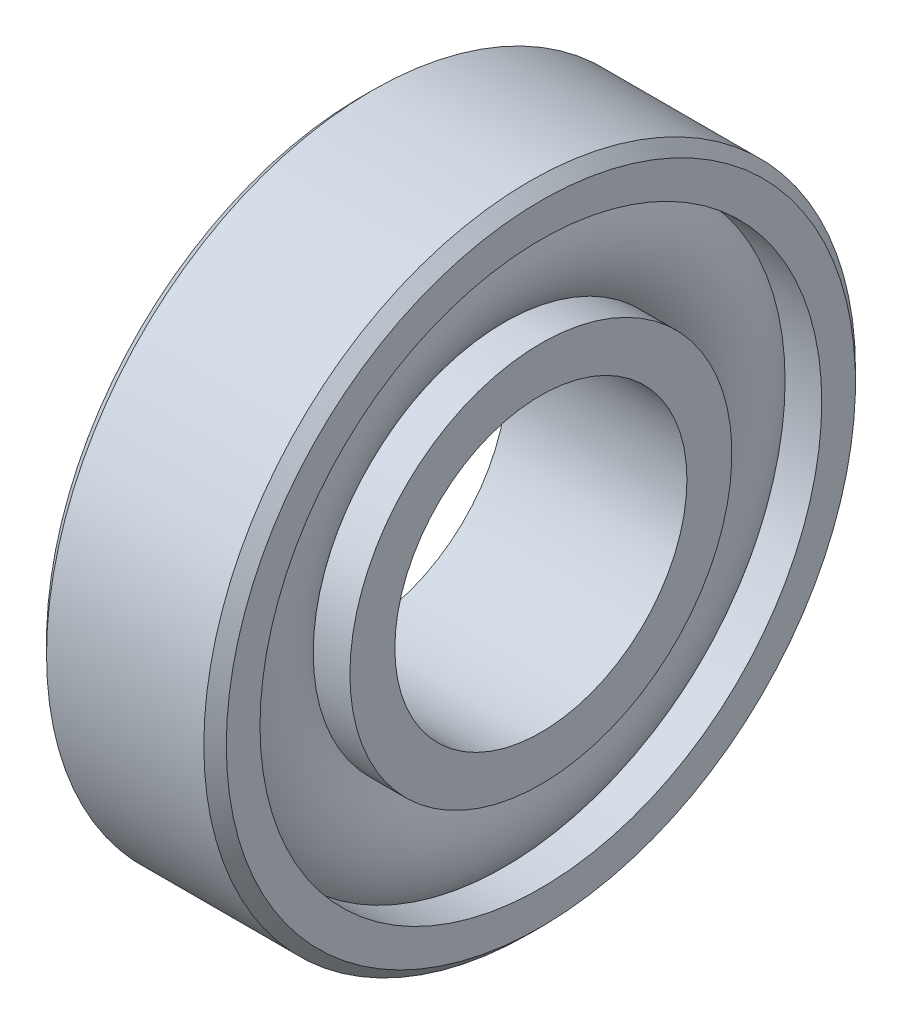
from build123d import *

# Parameters (mm, degrees)
CHANFREIN1_SIZE = 0.5


with BuildPart() as part:
    # Esquisse1 → Base-R_volution (revolve)
    with BuildSketch(Plane.XY, mode=Mode.PRIVATE) as base_r_volution_sk:
        with BuildLine():
            Line((0, 14.5), (8, 14.5))
            Line((8, 14.5), (8, 12.5))
            Line((8, 12.5), (6.368543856, 12.5))
            ThreePointArc((6.368543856, 12.5), (7.1, 10.5), (6.368543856, 8.5))
            Line((6.368543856, 8.5), (8, 8.5))
            Line((8, 8.5), (8, 6.5))
            Line((8, 6.5), (0, 6.5))
            Line((0, 6.5), (0, 8.5))
            Line((0, 8.5), (1.631456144, 8.5))
            ThreePointArc((1.631456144, 8.5), (0.9, 10.5), (1.631456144, 12.5))
            Line((1.631456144, 12.5), (0, 12.5))
            Line((0, 12.5), (0, 14.5))
        make_face()
    revolve(base_r_volution_sk.sketch.rotate(Axis((0, 0, 0), (1, 0, 0)), 90), axis=Axis((0, 0, 0), (1, 0, 0)))

    # Chanfrein1
    chanfrein1_edges = [part.edges().sort_by_distance(p)[0] for p in [
        (0, 0, -14.5),
        (8, 0, -14.5),
    ]]
    chamfer(chanfrein1_edges, length=CHANFREIN1_SIZE)


solid = part.part
